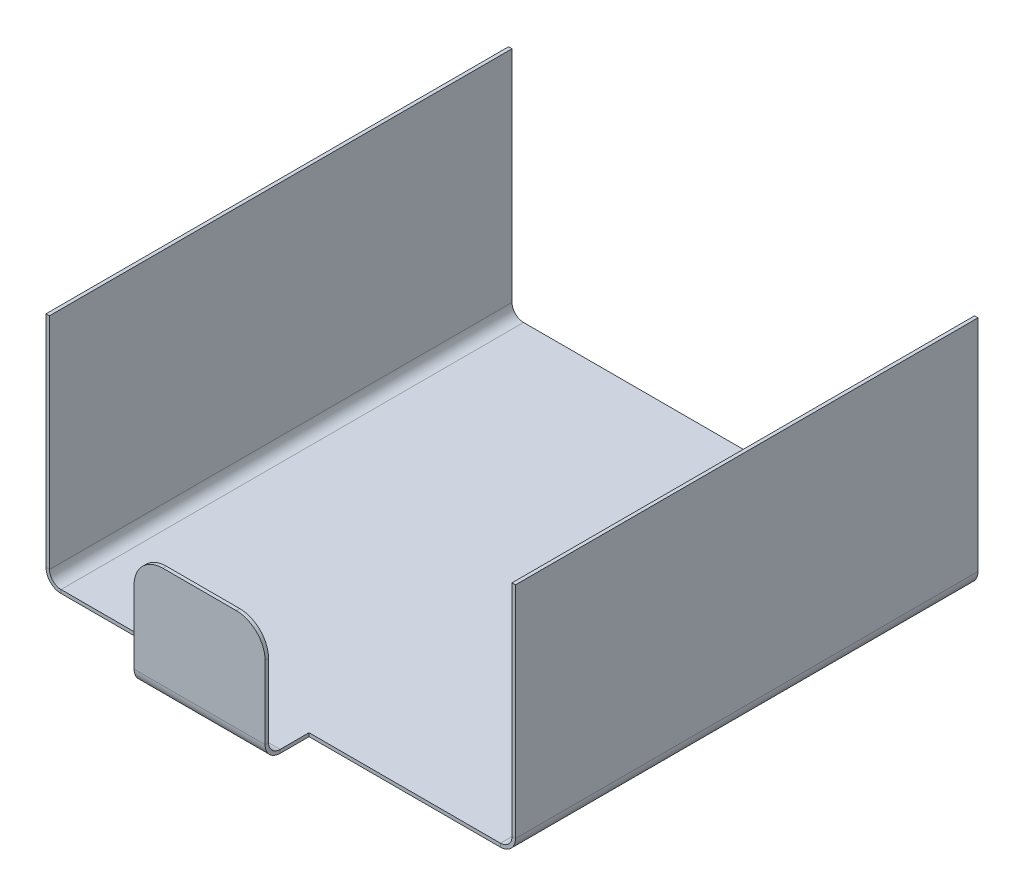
ISO-10303-21;
HEADER;
FILE_DESCRIPTION(('STEP AP214'),'2;1');
FILE_NAME('part.step','',(''),(''),'','','');
FILE_SCHEMA(('AUTOMOTIVE_DESIGN { 1 0 10303 214 1 1 1 1 }'));
ENDSEC;
DATA;
#1=APPLICATION_CONTEXT('core data for automotive mechanical design processes');
#2=APPLICATION_PROTOCOL_DEFINITION('international standard','automotive_design',2000,#1);
#3=PRODUCT_CONTEXT('',#1,'mechanical');
#4=PRODUCT('Part','Part','',(#3));
#5=PRODUCT_RELATED_PRODUCT_CATEGORY('part','',(#4));
#6=PRODUCT_DEFINITION_FORMATION('','',#4);
#7=PRODUCT_DEFINITION_CONTEXT('part definition',#1,'design');
#8=PRODUCT_DEFINITION('design','',#6,#7);
#9=PRODUCT_DEFINITION_SHAPE('','',#8);
#10=(LENGTH_UNIT() NAMED_UNIT(*) SI_UNIT(.MILLI.,.METRE.));
#11=(NAMED_UNIT(*) PLANE_ANGLE_UNIT() SI_UNIT($,.RADIAN.));
#12=(NAMED_UNIT(*) SI_UNIT($,.STERADIAN.) SOLID_ANGLE_UNIT());
#13=UNCERTAINTY_MEASURE_WITH_UNIT(LENGTH_MEASURE(1.E-05),#10,'distance_accuracy_value','');
#14=(GEOMETRIC_REPRESENTATION_CONTEXT(3) GLOBAL_UNCERTAINTY_ASSIGNED_CONTEXT((#13)) GLOBAL_UNIT_ASSIGNED_CONTEXT((#10,
#11,#12)) REPRESENTATION_CONTEXT('',''));
#15=CARTESIAN_POINT('',(0.,0.,0.));
#16=DIRECTION('',(0.,0.,1.));
#17=DIRECTION('',(1.,0.,0.));
#18=AXIS2_PLACEMENT_3D('',#15,#16,#17);
#19=CARTESIAN_POINT('',(-51.562,2.54,50.8));
#20=DIRECTION('',(0.,0.,1.));
#21=DIRECTION('',(1.,0.,0.));
#22=AXIS2_PLACEMENT_3D('',#19,#20,#21);
#23=PLANE('',#22);
#24=DIRECTION('',(-1.,0.,0.));
#25=VECTOR('',#24,1.);
#26=CARTESIAN_POINT('',(-50.8,0.,50.8));
#27=LINE('',#26,#25);
#28=CARTESIAN_POINT('',(48.26,0.,50.8));
#29=VERTEX_POINT('',#28);
#30=CARTESIAN_POINT('',(6.21680783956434,0.,50.8));
#31=VERTEX_POINT('',#30);
#32=EDGE_CURVE('E342',#29,#31,#27,.T.);
#33=ORIENTED_EDGE('',*,*,#32,.T.);
#34=DIRECTION('',(0.,-1.,0.));
#35=VECTOR('',#34,1.);
#36=CARTESIAN_POINT('',(6.21680783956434,0.,50.8));
#37=LINE('',#36,#35);
#38=CARTESIAN_POINT('',(6.21680783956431,-0.762,50.8));
#39=VERTEX_POINT('',#38);
#40=EDGE_CURVE('E288',#31,#39,#37,.T.);
#41=ORIENTED_EDGE('',*,*,#40,.T.);
#42=DIRECTION('',(1.,0.,0.));
#43=VECTOR('',#42,1.);
#44=CARTESIAN_POINT('',(-50.8,-0.762,50.8));
#45=LINE('',#44,#43);
#46=CARTESIAN_POINT('',(48.26,-0.762,50.8));
#47=VERTEX_POINT('',#46);
#48=EDGE_CURVE('E312',#47,#39,#45,.F.);
#49=ORIENTED_EDGE('',*,*,#48,.F.);
#50=DIRECTION('',(0.,1.,0.));
#51=VECTOR('',#50,1.);
#52=CARTESIAN_POINT('',(48.26,-0.762,50.8));
#53=LINE('',#52,#51);
#54=EDGE_CURVE('E63',#47,#29,#53,.T.);
#55=ORIENTED_EDGE('',*,*,#54,.T.);
#56=EDGE_LOOP('',(#33,#41,#49,#55));
#57=FACE_BOUND('',#56,.T.);
#58=ADVANCED_FACE('F54',(#57),#23,.T.);
#59=CARTESIAN_POINT('',(50.8,2.54,50.8));
#60=DIRECTION('',(0.,0.,1.));
#61=DIRECTION('',(1.,0.,0.));
#62=AXIS2_PLACEMENT_3D('',#59,#60,#61);
#63=PLANE('',#62);
#64=DIRECTION('',(1.,0.,0.));
#65=VECTOR('',#64,1.);
#66=CARTESIAN_POINT('',(50.8,2.54,50.8));
#67=LINE('',#66,#65);
#68=CARTESIAN_POINT('',(50.8,2.54,50.8));
#69=VERTEX_POINT('',#68);
#70=CARTESIAN_POINT('',(51.562,2.54,50.8));
#71=VERTEX_POINT('',#70);
#72=EDGE_CURVE('E13',#69,#71,#67,.T.);
#73=ORIENTED_EDGE('',*,*,#72,.F.);
#74=CARTESIAN_POINT('',(48.26,2.54,50.8));
#75=DIRECTION('',(0.,0.,1.));
#76=DIRECTION('',(1.,0.,0.));
#77=AXIS2_PLACEMENT_3D('',#74,#75,#76);
#78=CIRCLE('',#77,2.54);
#79=EDGE_CURVE('E332',#69,#29,#78,.F.);
#80=ORIENTED_EDGE('',*,*,#79,.T.);
#81=ORIENTED_EDGE('',*,*,#54,.F.);
#82=CARTESIAN_POINT('',(48.26,2.54,50.8));
#83=DIRECTION('',(0.,0.,1.));
#84=DIRECTION('',(1.,0.,0.));
#85=AXIS2_PLACEMENT_3D('',#82,#83,#84);
#86=CIRCLE('',#85,3.302);
#87=EDGE_CURVE('E319',#71,#47,#86,.F.);
#88=ORIENTED_EDGE('',*,*,#87,.F.);
#89=EDGE_LOOP('',(#73,#80,#81,#88));
#90=FACE_BOUND('',#89,.T.);
#91=ADVANCED_FACE('F56',(#90),#63,.T.);
#92=CARTESIAN_POINT('',(48.26,-0.762,50.8));
#93=DIRECTION('',(0.,0.,1.));
#94=DIRECTION('',(1.,0.,0.));
#95=AXIS2_PLACEMENT_3D('',#92,#93,#94);
#96=PLANE('',#95);
#97=DIRECTION('',(0.,-1.,0.));
#98=VECTOR('',#97,1.);
#99=CARTESIAN_POINT('',(50.8,0.,50.8));
#100=LINE('',#99,#98);
#101=CARTESIAN_POINT('',(50.8,50.8,50.8));
#102=VERTEX_POINT('',#101);
#103=EDGE_CURVE('E329',#102,#69,#100,.T.);
#104=ORIENTED_EDGE('',*,*,#103,.T.);
#105=ORIENTED_EDGE('',*,*,#72,.T.);
#106=DIRECTION('',(0.,1.,0.));
#107=VECTOR('',#106,1.);
#108=CARTESIAN_POINT('',(51.562,0.,50.8));
#109=LINE('',#108,#107);
#110=CARTESIAN_POINT('',(51.562,50.8,50.8));
#111=VERTEX_POINT('',#110);
#112=EDGE_CURVE('E323',#111,#71,#109,.F.);
#113=ORIENTED_EDGE('',*,*,#112,.F.);
#114=DIRECTION('',(1.,0.,0.));
#115=VECTOR('',#114,1.);
#116=CARTESIAN_POINT('',(50.8,50.8,50.8));
#117=LINE('',#116,#115);
#118=EDGE_CURVE('E326',#102,#111,#117,.T.);
#119=ORIENTED_EDGE('',*,*,#118,.F.);
#120=EDGE_LOOP('',(#104,#105,#113,#119));
#121=FACE_BOUND('',#120,.T.);
#122=ADVANCED_FACE('F539',(#121),#96,.T.);
#123=CARTESIAN_POINT('',(48.26,0.,-50.8));
#124=DIRECTION('',(0.,0.,-1.));
#125=DIRECTION('',(-1.,0.,0.));
#126=AXIS2_PLACEMENT_3D('',#123,#124,#125);
#127=PLANE('',#126);
#128=DIRECTION('',(0.,-1.,0.));
#129=VECTOR('',#128,1.);
#130=CARTESIAN_POINT('',(48.26,0.,-50.8));
#131=LINE('',#130,#129);
#132=CARTESIAN_POINT('',(48.26,0.,-50.8));
#133=VERTEX_POINT('',#132);
#134=CARTESIAN_POINT('',(48.26,-0.762,-50.8));
#135=VERTEX_POINT('',#134);
#136=EDGE_CURVE('E346',#133,#135,#131,.T.);
#137=ORIENTED_EDGE('',*,*,#136,.F.);
#138=CARTESIAN_POINT('',(48.26,2.54,-50.8));
#139=DIRECTION('',(0.,0.,1.));
#140=DIRECTION('',(1.,0.,0.));
#141=AXIS2_PLACEMENT_3D('',#138,#139,#140);
#142=CIRCLE('',#141,2.54);
#143=CARTESIAN_POINT('',(50.8,2.54,-50.8));
#144=VERTEX_POINT('',#143);
#145=EDGE_CURVE('E467',#144,#133,#142,.F.);
#146=ORIENTED_EDGE('',*,*,#145,.F.);
#147=DIRECTION('',(-1.,0.,0.));
#148=VECTOR('',#147,1.);
#149=CARTESIAN_POINT('',(51.562,2.54,-50.8));
#150=LINE('',#149,#148);
#151=CARTESIAN_POINT('',(51.562,2.54,-50.8));
#152=VERTEX_POINT('',#151);
#153=EDGE_CURVE('E348',#152,#144,#150,.T.);
#154=ORIENTED_EDGE('',*,*,#153,.F.);
#155=CARTESIAN_POINT('',(48.26,2.54,-50.8));
#156=DIRECTION('',(0.,0.,1.));
#157=DIRECTION('',(1.,0.,0.));
#158=AXIS2_PLACEMENT_3D('',#155,#156,#157);
#159=CIRCLE('',#158,3.302);
#160=EDGE_CURVE('E456',#152,#135,#159,.F.);
#161=ORIENTED_EDGE('',*,*,#160,.T.);
#162=EDGE_LOOP('',(#137,#146,#154,#161));
#163=FACE_BOUND('',#162,.T.);
#164=ADVANCED_FACE('F551',(#163),#127,.T.);
#165=CARTESIAN_POINT('',(51.562,2.54,-50.8));
#166=DIRECTION('',(0.,0.,-1.));
#167=DIRECTION('',(-1.,0.,0.));
#168=AXIS2_PLACEMENT_3D('',#165,#166,#167);
#169=PLANE('',#168);
#170=DIRECTION('',(-1.,0.,0.));
#171=VECTOR('',#170,1.);
#172=CARTESIAN_POINT('',(-50.8,0.,-50.8));
#173=LINE('',#172,#171);
#174=CARTESIAN_POINT('',(-48.26,0.,-50.8));
#175=VERTEX_POINT('',#174);
#176=EDGE_CURVE('E414',#133,#175,#173,.T.);
#177=ORIENTED_EDGE('',*,*,#176,.F.);
#178=ORIENTED_EDGE('',*,*,#136,.T.);
#179=DIRECTION('',(1.,0.,0.));
#180=VECTOR('',#179,1.);
#181=CARTESIAN_POINT('',(-50.8,-0.762,-50.8));
#182=LINE('',#181,#180);
#183=CARTESIAN_POINT('',(-48.26,-0.762,-50.8));
#184=VERTEX_POINT('',#183);
#185=EDGE_CURVE('E431',#135,#184,#182,.F.);
#186=ORIENTED_EDGE('',*,*,#185,.T.);
#187=DIRECTION('',(0.,1.,0.));
#188=VECTOR('',#187,1.);
#189=CARTESIAN_POINT('',(-48.26,-0.762,-50.8));
#190=LINE('',#189,#188);
#191=EDGE_CURVE('E356',#184,#175,#190,.T.);
#192=ORIENTED_EDGE('',*,*,#191,.T.);
#193=EDGE_LOOP('',(#177,#178,#186,#192));
#194=FACE_BOUND('',#193,.T.);
#195=ADVANCED_FACE('F478',(#194),#169,.T.);
#196=CARTESIAN_POINT('',(-48.26,0.,50.8));
#197=DIRECTION('',(0.,0.,1.));
#198=DIRECTION('',(1.,0.,0.));
#199=AXIS2_PLACEMENT_3D('',#196,#197,#198);
#200=PLANE('',#199);
#201=DIRECTION('',(0.,-1.,0.));
#202=VECTOR('',#201,1.);
#203=CARTESIAN_POINT('',(-48.26,0.,50.8));
#204=LINE('',#203,#202);
#205=CARTESIAN_POINT('',(-48.26,0.,50.8));
#206=VERTEX_POINT('',#205);
#207=CARTESIAN_POINT('',(-48.26,-0.762,50.8));
#208=VERTEX_POINT('',#207);
#209=EDGE_CURVE('E350',#206,#208,#204,.T.);
#210=ORIENTED_EDGE('',*,*,#209,.F.);
#211=CARTESIAN_POINT('',(-48.26,2.54,50.8));
#212=DIRECTION('',(0.,0.,1.));
#213=DIRECTION('',(1.,0.,0.));
#214=AXIS2_PLACEMENT_3D('',#211,#212,#213);
#215=CIRCLE('',#214,2.54);
#216=CARTESIAN_POINT('',(-50.8,2.54,50.8));
#217=VERTEX_POINT('',#216);
#218=EDGE_CURVE('E338',#206,#217,#215,.F.);
#219=ORIENTED_EDGE('',*,*,#218,.T.);
#220=DIRECTION('',(1.,0.,0.));
#221=VECTOR('',#220,1.);
#222=CARTESIAN_POINT('',(-51.562,2.54,50.8));
#223=LINE('',#222,#221);
#224=CARTESIAN_POINT('',(-51.562,2.54,50.8));
#225=VERTEX_POINT('',#224);
#226=EDGE_CURVE('E79',#225,#217,#223,.T.);
#227=ORIENTED_EDGE('',*,*,#226,.F.);
#228=CARTESIAN_POINT('',(-48.26,2.54,50.8));
#229=DIRECTION('',(0.,0.,1.));
#230=DIRECTION('',(1.,0.,0.));
#231=AXIS2_PLACEMENT_3D('',#228,#229,#230);
#232=CIRCLE('',#231,3.302);
#233=EDGE_CURVE('E313',#208,#225,#232,.F.);
#234=ORIENTED_EDGE('',*,*,#233,.F.);
#235=EDGE_LOOP('',(#210,#219,#227,#234));
#236=FACE_BOUND('',#235,.T.);
#237=ADVANCED_FACE('F396',(#236),#200,.T.);
#238=DIRECTION('',(0.,-1.,0.));
#239=VECTOR('',#238,1.);
#240=CARTESIAN_POINT('',(-22.5653766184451,0.,50.8));
#241=LINE('',#240,#239);
#242=CARTESIAN_POINT('',(-22.5653766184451,0.,50.8));
#243=VERTEX_POINT('',#242);
#244=CARTESIAN_POINT('',(-22.5653766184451,-0.762000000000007,50.8));
#245=VERTEX_POINT('',#244);
#246=EDGE_CURVE('E279',#243,#245,#241,.T.);
#247=ORIENTED_EDGE('',*,*,#246,.F.);
#248=EDGE_CURVE('E335',#243,#206,#27,.T.);
#249=ORIENTED_EDGE('',*,*,#248,.T.);
#250=ORIENTED_EDGE('',*,*,#209,.T.);
#251=EDGE_CURVE('E309',#245,#208,#45,.F.);
#252=ORIENTED_EDGE('',*,*,#251,.F.);
#253=EDGE_LOOP('',(#247,#249,#250,#252));
#254=FACE_BOUND('',#253,.T.);
#255=ADVANCED_FACE('F435',(#254),#23,.T.);
#256=CARTESIAN_POINT('',(-50.8,2.54,-50.8));
#257=DIRECTION('',(0.,0.,-1.));
#258=DIRECTION('',(-1.,0.,0.));
#259=AXIS2_PLACEMENT_3D('',#256,#257,#258);
#260=PLANE('',#259);
#261=DIRECTION('',(-1.,0.,0.));
#262=VECTOR('',#261,1.);
#263=CARTESIAN_POINT('',(-50.8,2.54,-50.8));
#264=LINE('',#263,#262);
#265=CARTESIAN_POINT('',(-50.8,2.54,-50.8));
#266=VERTEX_POINT('',#265);
#267=CARTESIAN_POINT('',(-51.562,2.54,-50.8));
#268=VERTEX_POINT('',#267);
#269=EDGE_CURVE('E354',#266,#268,#264,.T.);
#270=ORIENTED_EDGE('',*,*,#269,.F.);
#271=CARTESIAN_POINT('',(-48.26,2.54,-50.8));
#272=DIRECTION('',(0.,0.,1.));
#273=DIRECTION('',(1.,0.,0.));
#274=AXIS2_PLACEMENT_3D('',#271,#272,#273);
#275=CIRCLE('',#274,2.54);
#276=EDGE_CURVE('E404',#175,#266,#275,.F.);
#277=ORIENTED_EDGE('',*,*,#276,.F.);
#278=ORIENTED_EDGE('',*,*,#191,.F.);
#279=CARTESIAN_POINT('',(-48.26,2.54,-50.8));
#280=DIRECTION('',(0.,0.,1.));
#281=DIRECTION('',(1.,0.,0.));
#282=AXIS2_PLACEMENT_3D('',#279,#280,#281);
#283=CIRCLE('',#282,3.302);
#284=EDGE_CURVE('E426',#184,#268,#283,.F.);
#285=ORIENTED_EDGE('',*,*,#284,.T.);
#286=EDGE_LOOP('',(#270,#277,#278,#285));
#287=FACE_BOUND('',#286,.T.);
#288=ADVANCED_FACE('F443',(#287),#260,.T.);
#289=CARTESIAN_POINT('',(-48.26,-0.762,-50.8));
#290=DIRECTION('',(0.,0.,-1.));
#291=DIRECTION('',(-1.,0.,0.));
#292=AXIS2_PLACEMENT_3D('',#289,#290,#291);
#293=PLANE('',#292);
#294=DIRECTION('',(0.,1.,0.));
#295=VECTOR('',#294,1.);
#296=CARTESIAN_POINT('',(-50.8,0.,-50.8));
#297=LINE('',#296,#295);
#298=CARTESIAN_POINT('',(-50.8,50.8,-50.8));
#299=VERTEX_POINT('',#298);
#300=EDGE_CURVE('E306',#266,#299,#297,.T.);
#301=ORIENTED_EDGE('',*,*,#300,.F.);
#302=ORIENTED_EDGE('',*,*,#269,.T.);
#303=DIRECTION('',(0.,1.,0.));
#304=VECTOR('',#303,1.);
#305=CARTESIAN_POINT('',(-51.562,0.,-50.8));
#306=LINE('',#305,#304);
#307=CARTESIAN_POINT('',(-51.562,50.8,-50.8));
#308=VERTEX_POINT('',#307);
#309=EDGE_CURVE('E448',#268,#308,#306,.T.);
#310=ORIENTED_EDGE('',*,*,#309,.T.);
#311=DIRECTION('',(1.,0.,0.));
#312=VECTOR('',#311,1.);
#313=CARTESIAN_POINT('',(-51.562,50.8,-50.8));
#314=LINE('',#313,#312);
#315=EDGE_CURVE('E450',#308,#299,#314,.T.);
#316=ORIENTED_EDGE('',*,*,#315,.T.);
#317=EDGE_LOOP('',(#301,#302,#310,#316));
#318=FACE_BOUND('',#317,.T.);
#319=ADVANCED_FACE('F446',(#318),#293,.T.);
#320=CARTESIAN_POINT('',(-50.8,0.,50.8));
#321=DIRECTION('',(-1.,0.,0.));
#322=DIRECTION('',(0.,0.,1.));
#323=AXIS2_PLACEMENT_3D('',#320,#321,#322);
#324=PLANE('',#323);
#325=ORIENTED_EDGE('',*,*,#300,.T.);
#326=DIRECTION('',(0.,0.,-1.));
#327=VECTOR('',#326,1.);
#328=CARTESIAN_POINT('',(-50.8,50.8,50.8));
#329=LINE('',#328,#327);
#330=CARTESIAN_POINT('',(-50.8,50.8,50.8));
#331=VERTEX_POINT('',#330);
#332=EDGE_CURVE('E358',#331,#299,#329,.T.);
#333=ORIENTED_EDGE('',*,*,#332,.F.);
#334=DIRECTION('',(0.,1.,0.));
#335=VECTOR('',#334,1.);
#336=CARTESIAN_POINT('',(-50.8,0.,50.8));
#337=LINE('',#336,#335);
#338=EDGE_CURVE('E406',#217,#331,#337,.T.);
#339=ORIENTED_EDGE('',*,*,#338,.F.);
#340=DIRECTION('',(0.,0.,-1.));
#341=VECTOR('',#340,1.);
#342=CARTESIAN_POINT('',(-50.8,2.54,50.8));
#343=LINE('',#342,#341);
#344=EDGE_CURVE('E386',#217,#266,#343,.T.);
#345=ORIENTED_EDGE('',*,*,#344,.T.);
#346=EDGE_LOOP('',(#325,#333,#339,#345));
#347=FACE_BOUND('',#346,.T.);
#348=ADVANCED_FACE('F407',(#347),#324,.F.);
#349=CARTESIAN_POINT('',(-51.562,50.8,50.8));
#350=DIRECTION('',(0.,1.,0.));
#351=DIRECTION('',(-1.,0.,0.));
#352=AXIS2_PLACEMENT_3D('',#349,#350,#351);
#353=PLANE('',#352);
#354=ORIENTED_EDGE('',*,*,#315,.F.);
#355=DIRECTION('',(0.,0.,-1.));
#356=VECTOR('',#355,1.);
#357=CARTESIAN_POINT('',(-51.562,50.8,50.8));
#358=LINE('',#357,#356);
#359=CARTESIAN_POINT('',(-51.562,50.8,50.8));
#360=VERTEX_POINT('',#359);
#361=EDGE_CURVE('E360',#360,#308,#358,.T.);
#362=ORIENTED_EDGE('',*,*,#361,.F.);
#363=DIRECTION('',(1.,0.,0.));
#364=VECTOR('',#363,1.);
#365=CARTESIAN_POINT('',(-51.562,50.8,50.8));
#366=LINE('',#365,#364);
#367=EDGE_CURVE('E410',#360,#331,#366,.T.);
#368=ORIENTED_EDGE('',*,*,#367,.T.);
#369=ORIENTED_EDGE('',*,*,#332,.T.);
#370=EDGE_LOOP('',(#354,#362,#368,#369));
#371=FACE_BOUND('',#370,.T.);
#372=ADVANCED_FACE('F602',(#371),#353,.T.);
#373=CARTESIAN_POINT('',(-51.562,0.,50.8));
#374=DIRECTION('',(-1.,0.,0.));
#375=DIRECTION('',(0.,0.,1.));
#376=AXIS2_PLACEMENT_3D('',#373,#374,#375);
#377=PLANE('',#376);
#378=ORIENTED_EDGE('',*,*,#309,.F.);
#379=DIRECTION('',(0.,0.,-1.));
#380=VECTOR('',#379,1.);
#381=CARTESIAN_POINT('',(-51.562,2.54,50.8));
#382=LINE('',#381,#380);
#383=EDGE_CURVE('E362',#225,#268,#382,.T.);
#384=ORIENTED_EDGE('',*,*,#383,.F.);
#385=DIRECTION('',(0.,1.,0.));
#386=VECTOR('',#385,1.);
#387=CARTESIAN_POINT('',(-51.562,0.,50.8));
#388=LINE('',#387,#386);
#389=EDGE_CURVE('E412',#225,#360,#388,.T.);
#390=ORIENTED_EDGE('',*,*,#389,.T.);
#391=ORIENTED_EDGE('',*,*,#361,.T.);
#392=EDGE_LOOP('',(#378,#384,#390,#391));
#393=FACE_BOUND('',#392,.T.);
#394=ADVANCED_FACE('F599',(#393),#377,.T.);
#395=CARTESIAN_POINT('',(-48.26,2.54,50.8));
#396=DIRECTION('',(0.,0.,-1.));
#397=DIRECTION('',(-1.,0.,0.));
#398=AXIS2_PLACEMENT_3D('',#395,#396,#397);
#399=CYLINDRICAL_SURFACE('',#398,3.302);
#400=ORIENTED_EDGE('',*,*,#284,.F.);
#401=DIRECTION('',(0.,0.,-1.));
#402=VECTOR('',#401,1.);
#403=CARTESIAN_POINT('',(-48.26,-0.762,50.8));
#404=LINE('',#403,#402);
#405=EDGE_CURVE('E365',#208,#184,#404,.T.);
#406=ORIENTED_EDGE('',*,*,#405,.F.);
#407=ORIENTED_EDGE('',*,*,#233,.T.);
#408=ORIENTED_EDGE('',*,*,#383,.T.);
#409=EDGE_LOOP('',(#400,#406,#407,#408));
#410=FACE_BOUND('',#409,.T.);
#411=ADVANCED_FACE('F423',(#410),#399,.T.);
#412=CARTESIAN_POINT('',(-50.8,-0.762,50.8));
#413=DIRECTION('',(0.,-1.,0.));
#414=DIRECTION('',(0.,0.,-1.));
#415=AXIS2_PLACEMENT_3D('',#412,#413,#414);
#416=PLANE('',#415);
#417=ORIENTED_EDGE('',*,*,#185,.F.);
#418=DIRECTION('',(0.,0.,-1.));
#419=VECTOR('',#418,1.);
#420=CARTESIAN_POINT('',(48.26,-0.762,50.8));
#421=LINE('',#420,#419);
#422=EDGE_CURVE('E368',#47,#135,#421,.T.);
#423=ORIENTED_EDGE('',*,*,#422,.F.);
#424=ORIENTED_EDGE('',*,*,#48,.T.);
#425=DIRECTION('',(0.,0.,-1.));
#426=VECTOR('',#425,1.);
#427=CARTESIAN_POINT('',(6.21680783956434,-0.762000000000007,57.15));
#428=LINE('',#427,#426);
#429=CARTESIAN_POINT('',(6.21680783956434,-0.762000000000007,57.15));
#430=VERTEX_POINT('',#429);
#431=EDGE_CURVE('E71',#430,#39,#428,.T.);
#432=ORIENTED_EDGE('',*,*,#431,.F.);
#433=DIRECTION('',(1.,0.,0.));
#434=VECTOR('',#433,1.);
#435=CARTESIAN_POINT('',(6.21680783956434,-0.762000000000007,57.15));
#436=LINE('',#435,#434);
#437=CARTESIAN_POINT('',(-22.5653766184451,-0.762000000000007,57.15));
#438=VERTEX_POINT('',#437);
#439=EDGE_CURVE('E267',#430,#438,#436,.F.);
#440=ORIENTED_EDGE('',*,*,#439,.T.);
#441=DIRECTION('',(0.,0.,-1.));
#442=VECTOR('',#441,1.);
#443=CARTESIAN_POINT('',(-22.5653766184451,-0.762000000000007,57.15));
#444=LINE('',#443,#442);
#445=EDGE_CURVE('E291',#438,#245,#444,.T.);
#446=ORIENTED_EDGE('',*,*,#445,.T.);
#447=ORIENTED_EDGE('',*,*,#251,.T.);
#448=ORIENTED_EDGE('',*,*,#405,.T.);
#449=EDGE_LOOP('',(#417,#423,#424,#432,#440,#446,#447,#448));
#450=FACE_BOUND('',#449,.T.);
#451=ADVANCED_FACE('F429',(#450),#416,.T.);
#452=CARTESIAN_POINT('',(48.26,2.54,50.8));
#453=DIRECTION('',(0.,0.,-1.));
#454=DIRECTION('',(-1.,0.,0.));
#455=AXIS2_PLACEMENT_3D('',#452,#453,#454);
#456=CYLINDRICAL_SURFACE('',#455,3.302);
#457=ORIENTED_EDGE('',*,*,#160,.F.);
#458=DIRECTION('',(0.,0.,-1.));
#459=VECTOR('',#458,1.);
#460=CARTESIAN_POINT('',(51.562,2.54,50.8));
#461=LINE('',#460,#459);
#462=EDGE_CURVE('E371',#71,#152,#461,.T.);
#463=ORIENTED_EDGE('',*,*,#462,.F.);
#464=ORIENTED_EDGE('',*,*,#87,.T.);
#465=ORIENTED_EDGE('',*,*,#422,.T.);
#466=EDGE_LOOP('',(#457,#463,#464,#465));
#467=FACE_BOUND('',#466,.T.);
#468=ADVANCED_FACE('F481',(#467),#456,.T.);
#469=CARTESIAN_POINT('',(51.562,0.,50.8));
#470=DIRECTION('',(1.,0.,0.));
#471=DIRECTION('',(0.,0.,-1.));
#472=AXIS2_PLACEMENT_3D('',#469,#470,#471);
#473=PLANE('',#472);
#474=DIRECTION('',(0.,1.,0.));
#475=VECTOR('',#474,1.);
#476=CARTESIAN_POINT('',(51.562,0.,-50.8));
#477=LINE('',#476,#475);
#478=CARTESIAN_POINT('',(51.562,50.8,-50.8));
#479=VERTEX_POINT('',#478);
#480=EDGE_CURVE('E458',#479,#152,#477,.F.);
#481=ORIENTED_EDGE('',*,*,#480,.F.);
#482=DIRECTION('',(0.,0.,-1.));
#483=VECTOR('',#482,1.);
#484=CARTESIAN_POINT('',(51.562,50.8,50.8));
#485=LINE('',#484,#483);
#486=EDGE_CURVE('E374',#111,#479,#485,.T.);
#487=ORIENTED_EDGE('',*,*,#486,.F.);
#488=ORIENTED_EDGE('',*,*,#112,.T.);
#489=ORIENTED_EDGE('',*,*,#462,.T.);
#490=EDGE_LOOP('',(#481,#487,#488,#489));
#491=FACE_BOUND('',#490,.T.);
#492=ADVANCED_FACE('F567',(#491),#473,.T.);
#493=CARTESIAN_POINT('',(50.8,50.8,50.8));
#494=DIRECTION('',(0.,1.,0.));
#495=DIRECTION('',(-1.,0.,0.));
#496=AXIS2_PLACEMENT_3D('',#493,#494,#495);
#497=PLANE('',#496);
#498=DIRECTION('',(1.,0.,0.));
#499=VECTOR('',#498,1.);
#500=CARTESIAN_POINT('',(50.8,50.8,-50.8));
#501=LINE('',#500,#499);
#502=CARTESIAN_POINT('',(50.8,50.8,-50.8));
#503=VERTEX_POINT('',#502);
#504=EDGE_CURVE('E461',#503,#479,#501,.T.);
#505=ORIENTED_EDGE('',*,*,#504,.F.);
#506=DIRECTION('',(0.,0.,-1.));
#507=VECTOR('',#506,1.);
#508=CARTESIAN_POINT('',(50.8,50.8,50.8));
#509=LINE('',#508,#507);
#510=EDGE_CURVE('E376',#102,#503,#509,.T.);
#511=ORIENTED_EDGE('',*,*,#510,.F.);
#512=ORIENTED_EDGE('',*,*,#118,.T.);
#513=ORIENTED_EDGE('',*,*,#486,.T.);
#514=EDGE_LOOP('',(#505,#511,#512,#513));
#515=FACE_BOUND('',#514,.T.);
#516=ADVANCED_FACE('F570',(#515),#497,.T.);
#517=CARTESIAN_POINT('',(50.8,0.,50.8));
#518=DIRECTION('',(1.,0.,0.));
#519=DIRECTION('',(0.,0.,-1.));
#520=AXIS2_PLACEMENT_3D('',#517,#518,#519);
#521=PLANE('',#520);
#522=DIRECTION('',(0.,-1.,0.));
#523=VECTOR('',#522,1.);
#524=CARTESIAN_POINT('',(50.8,0.,-50.8));
#525=LINE('',#524,#523);
#526=EDGE_CURVE('E464',#503,#144,#525,.T.);
#527=ORIENTED_EDGE('',*,*,#526,.T.);
#528=DIRECTION('',(0.,0.,-1.));
#529=VECTOR('',#528,1.);
#530=CARTESIAN_POINT('',(50.8,2.54,50.8));
#531=LINE('',#530,#529);
#532=EDGE_CURVE('E378',#69,#144,#531,.T.);
#533=ORIENTED_EDGE('',*,*,#532,.F.);
#534=ORIENTED_EDGE('',*,*,#103,.F.);
#535=ORIENTED_EDGE('',*,*,#510,.T.);
#536=EDGE_LOOP('',(#527,#533,#534,#535));
#537=FACE_BOUND('',#536,.T.);
#538=ADVANCED_FACE('F563',(#537),#521,.F.);
#539=CARTESIAN_POINT('',(48.26,2.54,50.8));
#540=DIRECTION('',(0.,0.,-1.));
#541=DIRECTION('',(-1.,0.,0.));
#542=AXIS2_PLACEMENT_3D('',#539,#540,#541);
#543=CYLINDRICAL_SURFACE('',#542,2.54);
#544=ORIENTED_EDGE('',*,*,#145,.T.);
#545=DIRECTION('',(0.,0.,-1.));
#546=VECTOR('',#545,1.);
#547=CARTESIAN_POINT('',(48.26,0.,50.8));
#548=LINE('',#547,#546);
#549=EDGE_CURVE('E381',#29,#133,#548,.T.);
#550=ORIENTED_EDGE('',*,*,#549,.F.);
#551=ORIENTED_EDGE('',*,*,#79,.F.);
#552=ORIENTED_EDGE('',*,*,#532,.T.);
#553=EDGE_LOOP('',(#544,#550,#551,#552));
#554=FACE_BOUND('',#553,.T.);
#555=ADVANCED_FACE('F472',(#554),#543,.F.);
#556=CARTESIAN_POINT('',(-50.8,0.,50.8));
#557=DIRECTION('',(0.,-1.,0.));
#558=DIRECTION('',(0.,0.,-1.));
#559=AXIS2_PLACEMENT_3D('',#556,#557,#558);
#560=PLANE('',#559);
#561=ORIENTED_EDGE('',*,*,#176,.T.);
#562=DIRECTION('',(0.,0.,-1.));
#563=VECTOR('',#562,1.);
#564=CARTESIAN_POINT('',(-48.26,0.,50.8));
#565=LINE('',#564,#563);
#566=EDGE_CURVE('E384',#206,#175,#565,.T.);
#567=ORIENTED_EDGE('',*,*,#566,.F.);
#568=ORIENTED_EDGE('',*,*,#248,.F.);
#569=DIRECTION('',(0.,0.,-1.));
#570=VECTOR('',#569,1.);
#571=CARTESIAN_POINT('',(-22.5653766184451,0.,57.15));
#572=LINE('',#571,#570);
#573=CARTESIAN_POINT('',(-22.5653766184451,0.,57.15));
#574=VERTEX_POINT('',#573);
#575=EDGE_CURVE('E292',#574,#243,#572,.T.);
#576=ORIENTED_EDGE('',*,*,#575,.F.);
#577=DIRECTION('',(1.,0.,0.));
#578=VECTOR('',#577,1.);
#579=CARTESIAN_POINT('',(6.21680783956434,0.,57.15));
#580=LINE('',#579,#578);
#581=CARTESIAN_POINT('',(6.21680783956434,0.,57.15));
#582=VERTEX_POINT('',#581);
#583=EDGE_CURVE('E262',#582,#574,#580,.F.);
#584=ORIENTED_EDGE('',*,*,#583,.F.);
#585=DIRECTION('',(0.,0.,-1.));
#586=VECTOR('',#585,1.);
#587=CARTESIAN_POINT('',(6.21680783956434,0.,57.15));
#588=LINE('',#587,#586);
#589=EDGE_CURVE('E295',#582,#31,#588,.T.);
#590=ORIENTED_EDGE('',*,*,#589,.T.);
#591=ORIENTED_EDGE('',*,*,#32,.F.);
#592=ORIENTED_EDGE('',*,*,#549,.T.);
#593=EDGE_LOOP('',(#561,#567,#568,#576,#584,#590,#591,#592));
#594=FACE_BOUND('',#593,.T.);
#595=ADVANCED_FACE('F439',(#594),#560,.F.);
#596=CARTESIAN_POINT('',(-48.26,2.54,50.8));
#597=DIRECTION('',(0.,0.,-1.));
#598=DIRECTION('',(-1.,0.,0.));
#599=AXIS2_PLACEMENT_3D('',#596,#597,#598);
#600=CYLINDRICAL_SURFACE('',#599,2.54);
#601=ORIENTED_EDGE('',*,*,#276,.T.);
#602=ORIENTED_EDGE('',*,*,#344,.F.);
#603=ORIENTED_EDGE('',*,*,#218,.F.);
#604=ORIENTED_EDGE('',*,*,#566,.T.);
#605=EDGE_LOOP('',(#601,#602,#603,#604));
#606=FACE_BOUND('',#605,.T.);
#607=ADVANCED_FACE('F402',(#606),#600,.F.);
#608=CARTESIAN_POINT('',(-48.26,2.54,50.8));
#609=DIRECTION('',(0.,0.,1.));
#610=DIRECTION('',(1.,0.,0.));
#611=AXIS2_PLACEMENT_3D('',#608,#609,#610);
#612=PLANE('',#611);
#613=ORIENTED_EDGE('',*,*,#338,.T.);
#614=ORIENTED_EDGE('',*,*,#367,.F.);
#615=ORIENTED_EDGE('',*,*,#389,.F.);
#616=ORIENTED_EDGE('',*,*,#226,.T.);
#617=EDGE_LOOP('',(#613,#614,#615,#616));
#618=FACE_BOUND('',#617,.T.);
#619=ADVANCED_FACE('F573',(#618),#612,.T.);
#620=CARTESIAN_POINT('',(-48.26,2.54,-50.8));
#621=DIRECTION('',(0.,0.,1.));
#622=DIRECTION('',(1.,0.,0.));
#623=AXIS2_PLACEMENT_3D('',#620,#621,#622);
#624=PLANE('',#623);
#625=ORIENTED_EDGE('',*,*,#480,.T.);
#626=ORIENTED_EDGE('',*,*,#153,.T.);
#627=ORIENTED_EDGE('',*,*,#526,.F.);
#628=ORIENTED_EDGE('',*,*,#504,.T.);
#629=EDGE_LOOP('',(#625,#626,#627,#628));
#630=FACE_BOUND('',#629,.T.);
#631=ADVANCED_FACE('F572',(#630),#624,.F.);
#632=CARTESIAN_POINT('',(6.21680783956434,0.,57.15));
#633=DIRECTION('',(1.,0.,0.));
#634=DIRECTION('',(0.,-1.,0.));
#635=AXIS2_PLACEMENT_3D('',#632,#633,#634);
#636=PLANE('',#635);
#637=ORIENTED_EDGE('',*,*,#589,.F.);
#638=DIRECTION('',(0.,-1.,0.));
#639=VECTOR('',#638,1.);
#640=CARTESIAN_POINT('',(6.21680783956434,0.,57.15));
#641=LINE('',#640,#639);
#642=EDGE_CURVE('E273',#582,#430,#641,.T.);
#643=ORIENTED_EDGE('',*,*,#642,.T.);
#644=ORIENTED_EDGE('',*,*,#431,.T.);
#645=ORIENTED_EDGE('',*,*,#40,.F.);
#646=EDGE_LOOP('',(#637,#643,#644,#645));
#647=FACE_BOUND('',#646,.T.);
#648=ADVANCED_FACE('F488',(#647),#636,.T.);
#649=CARTESIAN_POINT('',(-22.5653766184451,0.,57.15));
#650=DIRECTION('',(1.,0.,0.));
#651=DIRECTION('',(0.,-1.,0.));
#652=AXIS2_PLACEMENT_3D('',#649,#650,#651);
#653=PLANE('',#652);
#654=ORIENTED_EDGE('',*,*,#445,.F.);
#655=DIRECTION('',(0.,-1.,0.));
#656=VECTOR('',#655,1.);
#657=CARTESIAN_POINT('',(-22.5653766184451,0.,57.15));
#658=LINE('',#657,#656);
#659=EDGE_CURVE('E276',#574,#438,#658,.T.);
#660=ORIENTED_EDGE('',*,*,#659,.F.);
#661=ORIENTED_EDGE('',*,*,#575,.T.);
#662=ORIENTED_EDGE('',*,*,#246,.T.);
#663=EDGE_LOOP('',(#654,#660,#661,#662));
#664=FACE_BOUND('',#663,.T.);
#665=ADVANCED_FACE('F527',(#664),#653,.F.);
#666=CARTESIAN_POINT('',(-22.5653766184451,2.53999999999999,57.15));
#667=DIRECTION('',(-1.,0.,0.));
#668=DIRECTION('',(0.,0.,1.));
#669=AXIS2_PLACEMENT_3D('',#666,#667,#668);
#670=PLANE('',#669);
#671=DIRECTION('',(0.,0.,-1.));
#672=VECTOR('',#671,1.);
#673=CARTESIAN_POINT('',(-22.5653766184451,2.53999999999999,60.452));
#674=LINE('',#673,#672);
#675=CARTESIAN_POINT('',(-22.5653766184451,2.53999999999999,59.69));
#676=VERTEX_POINT('',#675);
#677=CARTESIAN_POINT('',(-22.5653766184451,2.53999999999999,60.452));
#678=VERTEX_POINT('',#677);
#679=EDGE_CURVE('E230',#676,#678,#674,.F.);
#680=ORIENTED_EDGE('',*,*,#679,.F.);
#681=CARTESIAN_POINT('',(-22.5653766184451,2.53999999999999,57.15));
#682=DIRECTION('',(1.,0.,0.));
#683=DIRECTION('',(0.,0.,-1.));
#684=AXIS2_PLACEMENT_3D('',#681,#682,#683);
#685=CIRCLE('',#684,2.54);
#686=EDGE_CURVE('E258',#574,#676,#685,.F.);
#687=ORIENTED_EDGE('',*,*,#686,.F.);
#688=ORIENTED_EDGE('',*,*,#659,.T.);
#689=CARTESIAN_POINT('',(-22.5653766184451,2.53999999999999,57.15));
#690=DIRECTION('',(1.,0.,0.));
#691=DIRECTION('',(0.,0.,-1.));
#692=AXIS2_PLACEMENT_3D('',#689,#690,#691);
#693=CIRCLE('',#692,3.302);
#694=EDGE_CURVE('E270',#438,#678,#693,.F.);
#695=ORIENTED_EDGE('',*,*,#694,.T.);
#696=EDGE_LOOP('',(#680,#687,#688,#695));
#697=FACE_BOUND('',#696,.T.);
#698=ADVANCED_FACE('F495',(#697),#670,.T.);
#699=CARTESIAN_POINT('',(6.21680783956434,2.53999999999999,57.15));
#700=DIRECTION('',(-1.,0.,0.));
#701=DIRECTION('',(0.,0.,1.));
#702=AXIS2_PLACEMENT_3D('',#699,#700,#701);
#703=PLANE('',#702);
#704=CARTESIAN_POINT('',(6.21680783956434,2.53999999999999,57.15));
#705=DIRECTION('',(1.,0.,0.));
#706=DIRECTION('',(0.,0.,-1.));
#707=AXIS2_PLACEMENT_3D('',#704,#705,#706);
#708=CIRCLE('',#707,2.54);
#709=CARTESIAN_POINT('',(6.21680783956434,2.53999999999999,59.69));
#710=VERTEX_POINT('',#709);
#711=EDGE_CURVE('E264',#710,#582,#708,.T.);
#712=ORIENTED_EDGE('',*,*,#711,.F.);
#713=DIRECTION('',(0.,0.,-1.));
#714=VECTOR('',#713,1.);
#715=CARTESIAN_POINT('',(6.21680783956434,2.53999999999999,59.69));
#716=LINE('',#715,#714);
#717=CARTESIAN_POINT('',(6.21680783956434,2.53999999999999,60.452));
#718=VERTEX_POINT('',#717);
#719=EDGE_CURVE('E252',#710,#718,#716,.F.);
#720=ORIENTED_EDGE('',*,*,#719,.T.);
#721=CARTESIAN_POINT('',(6.21680783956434,2.53999999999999,57.15));
#722=DIRECTION('',(1.,0.,0.));
#723=DIRECTION('',(0.,0.,-1.));
#724=AXIS2_PLACEMENT_3D('',#721,#722,#723);
#725=CIRCLE('',#724,3.302);
#726=EDGE_CURVE('E261',#718,#430,#725,.T.);
#727=ORIENTED_EDGE('',*,*,#726,.T.);
#728=ORIENTED_EDGE('',*,*,#642,.F.);
#729=EDGE_LOOP('',(#712,#720,#727,#728));
#730=FACE_BOUND('',#729,.T.);
#731=ADVANCED_FACE('F519',(#730),#703,.F.);
#732=CARTESIAN_POINT('',(6.21680783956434,2.53999999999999,57.15));
#733=DIRECTION('',(1.,0.,0.));
#734=DIRECTION('',(0.,0.,1.));
#735=AXIS2_PLACEMENT_3D('',#732,#733,#734);
#736=CYLINDRICAL_SURFACE('',#735,3.302);
#737=ORIENTED_EDGE('',*,*,#439,.F.);
#738=ORIENTED_EDGE('',*,*,#726,.F.);
#739=DIRECTION('',(1.,0.,0.));
#740=VECTOR('',#739,1.);
#741=CARTESIAN_POINT('',(-22.5653766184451,2.53999999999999,60.452));
#742=LINE('',#741,#740);
#743=EDGE_CURVE('E250',#718,#678,#742,.F.);
#744=ORIENTED_EDGE('',*,*,#743,.T.);
#745=ORIENTED_EDGE('',*,*,#694,.F.);
#746=EDGE_LOOP('',(#737,#738,#744,#745));
#747=FACE_BOUND('',#746,.T.);
#748=ADVANCED_FACE('F497',(#747),#736,.T.);
#749=CARTESIAN_POINT('',(6.21680783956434,2.53999999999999,57.15));
#750=DIRECTION('',(1.,0.,0.));
#751=DIRECTION('',(0.,0.,1.));
#752=AXIS2_PLACEMENT_3D('',#749,#750,#751);
#753=CYLINDRICAL_SURFACE('',#752,2.54);
#754=ORIENTED_EDGE('',*,*,#583,.T.);
#755=ORIENTED_EDGE('',*,*,#686,.T.);
#756=DIRECTION('',(1.,0.,0.));
#757=VECTOR('',#756,1.);
#758=CARTESIAN_POINT('',(-22.5653766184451,2.53999999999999,59.69));
#759=LINE('',#758,#757);
#760=EDGE_CURVE('E255',#676,#710,#759,.T.);
#761=ORIENTED_EDGE('',*,*,#760,.T.);
#762=ORIENTED_EDGE('',*,*,#711,.T.);
#763=EDGE_LOOP('',(#754,#755,#761,#762));
#764=FACE_BOUND('',#763,.T.);
#765=ADVANCED_FACE('F491',(#764),#753,.F.);
#766=CARTESIAN_POINT('',(6.21680783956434,18.542,60.452));
#767=DIRECTION('',(-1.,0.,0.));
#768=DIRECTION('',(0.,0.,1.));
#769=AXIS2_PLACEMENT_3D('',#766,#767,#768);
#770=PLANE('',#769);
#771=ORIENTED_EDGE('',*,*,#719,.F.);
#772=DIRECTION('',(0.,-1.,0.));
#773=VECTOR('',#772,1.);
#774=CARTESIAN_POINT('',(6.21680783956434,18.542,59.69));
#775=LINE('',#774,#773);
#776=CARTESIAN_POINT('',(6.21680783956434,18.542,59.69));
#777=VERTEX_POINT('',#776);
#778=EDGE_CURVE('E248',#710,#777,#775,.F.);
#779=ORIENTED_EDGE('',*,*,#778,.T.);
#780=DIRECTION('',(0.,0.,-1.));
#781=VECTOR('',#780,1.);
#782=CARTESIAN_POINT('',(6.21680783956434,18.542,60.452));
#783=LINE('',#782,#781);
#784=CARTESIAN_POINT('',(6.21680783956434,18.542,60.452));
#785=VERTEX_POINT('',#784);
#786=EDGE_CURVE('E233',#785,#777,#783,.T.);
#787=ORIENTED_EDGE('',*,*,#786,.F.);
#788=DIRECTION('',(0.,1.,0.));
#789=VECTOR('',#788,1.);
#790=CARTESIAN_POINT('',(6.21680783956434,18.542,60.452));
#791=LINE('',#790,#789);
#792=EDGE_CURVE('E239',#718,#785,#791,.T.);
#793=ORIENTED_EDGE('',*,*,#792,.F.);
#794=EDGE_LOOP('',(#771,#779,#787,#793));
#795=FACE_BOUND('',#794,.T.);
#796=ADVANCED_FACE('F502',(#795),#770,.F.);
#797=CARTESIAN_POINT('',(-22.5653766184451,0.,60.452));
#798=DIRECTION('',(1.,0.,0.));
#799=DIRECTION('',(0.,0.,-1.));
#800=AXIS2_PLACEMENT_3D('',#797,#798,#799);
#801=PLANE('',#800);
#802=ORIENTED_EDGE('',*,*,#679,.T.);
#803=DIRECTION('',(0.,-1.,0.));
#804=VECTOR('',#803,1.);
#805=CARTESIAN_POINT('',(-22.5653766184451,18.542,60.452));
#806=LINE('',#805,#804);
#807=CARTESIAN_POINT('',(-22.5653766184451,18.542,60.452));
#808=VERTEX_POINT('',#807);
#809=EDGE_CURVE('E211',#808,#678,#806,.T.);
#810=ORIENTED_EDGE('',*,*,#809,.F.);
#811=DIRECTION('',(0.,0.,-1.));
#812=VECTOR('',#811,1.);
#813=CARTESIAN_POINT('',(-22.5653766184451,18.542,60.452));
#814=LINE('',#813,#812);
#815=CARTESIAN_POINT('',(-22.5653766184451,18.542,59.69));
#816=VERTEX_POINT('',#815);
#817=EDGE_CURVE('E219',#808,#816,#814,.T.);
#818=ORIENTED_EDGE('',*,*,#817,.T.);
#819=DIRECTION('',(0.,1.,0.));
#820=VECTOR('',#819,1.);
#821=CARTESIAN_POINT('',(-22.5653766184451,0.,59.69));
#822=LINE('',#821,#820);
#823=EDGE_CURVE('E241',#816,#676,#822,.F.);
#824=ORIENTED_EDGE('',*,*,#823,.T.);
#825=EDGE_LOOP('',(#802,#810,#818,#824));
#826=FACE_BOUND('',#825,.T.);
#827=ADVANCED_FACE('F229',(#826),#801,.F.);
#828=CARTESIAN_POINT('',(-16.2153766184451,18.542,60.452));
#829=DIRECTION('',(0.,0.,-1.));
#830=DIRECTION('',(-1.,0.,0.));
#831=AXIS2_PLACEMENT_3D('',#828,#829,#830);
#832=PLANE('',#831);
#833=ORIENTED_EDGE('',*,*,#743,.F.);
#834=ORIENTED_EDGE('',*,*,#792,.T.);
#835=CARTESIAN_POINT('',(-0.13319216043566,18.542,60.452));
#836=DIRECTION('',(0.,0.,-1.));
#837=DIRECTION('',(-1.,0.,0.));
#838=AXIS2_PLACEMENT_3D('',#835,#836,#837);
#839=CIRCLE('',#838,6.35);
#840=CARTESIAN_POINT('',(-0.133192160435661,24.892,60.452));
#841=VERTEX_POINT('',#840);
#842=EDGE_CURVE('E237',#785,#841,#839,.F.);
#843=ORIENTED_EDGE('',*,*,#842,.T.);
#844=DIRECTION('',(-1.,0.,0.));
#845=VECTOR('',#844,1.);
#846=CARTESIAN_POINT('',(-16.2153766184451,24.892,60.452));
#847=LINE('',#846,#845);
#848=CARTESIAN_POINT('',(-16.2153766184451,24.892,60.452));
#849=VERTEX_POINT('',#848);
#850=EDGE_CURVE('E213',#841,#849,#847,.T.);
#851=ORIENTED_EDGE('',*,*,#850,.T.);
#852=CARTESIAN_POINT('',(-16.2153766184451,18.542,60.452));
#853=DIRECTION('',(0.,0.,-1.));
#854=DIRECTION('',(-1.,0.,0.));
#855=AXIS2_PLACEMENT_3D('',#852,#853,#854);
#856=CIRCLE('',#855,6.35);
#857=EDGE_CURVE('E206',#849,#808,#856,.F.);
#858=ORIENTED_EDGE('',*,*,#857,.T.);
#859=ORIENTED_EDGE('',*,*,#809,.T.);
#860=EDGE_LOOP('',(#833,#834,#843,#851,#858,#859));
#861=FACE_BOUND('',#860,.T.);
#862=ADVANCED_FACE('F209',(#861),#832,.F.);
#863=CARTESIAN_POINT('',(-16.2153766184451,18.542,59.69));
#864=DIRECTION('',(0.,0.,-1.));
#865=DIRECTION('',(-1.,0.,0.));
#866=AXIS2_PLACEMENT_3D('',#863,#864,#865);
#867=PLANE('',#866);
#868=ORIENTED_EDGE('',*,*,#778,.F.);
#869=ORIENTED_EDGE('',*,*,#760,.F.);
#870=ORIENTED_EDGE('',*,*,#823,.F.);
#871=CARTESIAN_POINT('',(-16.2153766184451,18.542,59.69));
#872=DIRECTION('',(0.,0.,-1.));
#873=DIRECTION('',(-1.,0.,0.));
#874=AXIS2_PLACEMENT_3D('',#871,#872,#873);
#875=CIRCLE('',#874,6.35);
#876=CARTESIAN_POINT('',(-16.2153766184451,24.892,59.69));
#877=VERTEX_POINT('',#876);
#878=EDGE_CURVE('E222',#877,#816,#875,.F.);
#879=ORIENTED_EDGE('',*,*,#878,.F.);
#880=DIRECTION('',(1.,0.,0.));
#881=VECTOR('',#880,1.);
#882=CARTESIAN_POINT('',(-16.2153766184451,24.892,59.69));
#883=LINE('',#882,#881);
#884=CARTESIAN_POINT('',(-0.133192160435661,24.892,59.69));
#885=VERTEX_POINT('',#884);
#886=EDGE_CURVE('E244',#885,#877,#883,.F.);
#887=ORIENTED_EDGE('',*,*,#886,.F.);
#888=CARTESIAN_POINT('',(-0.13319216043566,18.542,59.69));
#889=DIRECTION('',(0.,0.,-1.));
#890=DIRECTION('',(-1.,0.,0.));
#891=AXIS2_PLACEMENT_3D('',#888,#889,#890);
#892=CIRCLE('',#891,6.35);
#893=EDGE_CURVE('E246',#777,#885,#892,.F.);
#894=ORIENTED_EDGE('',*,*,#893,.F.);
#895=EDGE_LOOP('',(#868,#869,#870,#879,#887,#894));
#896=FACE_BOUND('',#895,.T.);
#897=ADVANCED_FACE('F517',(#896),#867,.T.);
#898=CARTESIAN_POINT('',(-0.13319216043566,18.542,60.452));
#899=DIRECTION('',(0.,0.,-1.));
#900=DIRECTION('',(-1.,0.,0.));
#901=AXIS2_PLACEMENT_3D('',#898,#899,#900);
#902=CYLINDRICAL_SURFACE('',#901,6.35);
#903=ORIENTED_EDGE('',*,*,#893,.T.);
#904=DIRECTION('',(0.,0.,-1.));
#905=VECTOR('',#904,1.);
#906=CARTESIAN_POINT('',(-0.133192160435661,24.892,60.452));
#907=LINE('',#906,#905);
#908=EDGE_CURVE('E508',#841,#885,#907,.T.);
#909=ORIENTED_EDGE('',*,*,#908,.F.);
#910=ORIENTED_EDGE('',*,*,#842,.F.);
#911=ORIENTED_EDGE('',*,*,#786,.T.);
#912=EDGE_LOOP('',(#903,#909,#910,#911));
#913=FACE_BOUND('',#912,.T.);
#914=ADVANCED_FACE('F510',(#913),#902,.T.);
#915=CARTESIAN_POINT('',(-16.2153766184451,24.892,60.452));
#916=DIRECTION('',(0.,-1.,0.));
#917=DIRECTION('',(0.,0.,-1.));
#918=AXIS2_PLACEMENT_3D('',#915,#916,#917);
#919=PLANE('',#918);
#920=ORIENTED_EDGE('',*,*,#886,.T.);
#921=DIRECTION('',(0.,0.,-1.));
#922=VECTOR('',#921,1.);
#923=CARTESIAN_POINT('',(-16.2153766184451,24.892,60.452));
#924=LINE('',#923,#922);
#925=EDGE_CURVE('E226',#849,#877,#924,.T.);
#926=ORIENTED_EDGE('',*,*,#925,.F.);
#927=ORIENTED_EDGE('',*,*,#850,.F.);
#928=ORIENTED_EDGE('',*,*,#908,.T.);
#929=EDGE_LOOP('',(#920,#926,#927,#928));
#930=FACE_BOUND('',#929,.T.);
#931=ADVANCED_FACE('F514',(#930),#919,.F.);
#932=CARTESIAN_POINT('',(-16.2153766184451,18.542,60.452));
#933=DIRECTION('',(0.,0.,-1.));
#934=DIRECTION('',(-1.,0.,0.));
#935=AXIS2_PLACEMENT_3D('',#932,#933,#934);
#936=CYLINDRICAL_SURFACE('',#935,6.35);
#937=ORIENTED_EDGE('',*,*,#878,.T.);
#938=ORIENTED_EDGE('',*,*,#817,.F.);
#939=ORIENTED_EDGE('',*,*,#857,.F.);
#940=ORIENTED_EDGE('',*,*,#925,.T.);
#941=EDGE_LOOP('',(#937,#938,#939,#940));
#942=FACE_BOUND('',#941,.T.);
#943=ADVANCED_FACE('F220',(#942),#936,.T.);
#944=CLOSED_SHELL('',(#58,#91,#122,#164,#195,#237,#255,#288,#319,#348,#372,#394,#411,#451,#468,
#492,#516,#538,#555,#595,#607,#619,#631,#648,#665,#698,#731,#748,#765,#796,#827,#862,#897,#914,
#931,#943));
#945=MANIFOLD_SOLID_BREP('B2',#944);
#946=ADVANCED_BREP_SHAPE_REPRESENTATION('',(#18,#945),#14);
#947=SHAPE_DEFINITION_REPRESENTATION(#9,#946);
ENDSEC;
END-ISO-10303-21;
